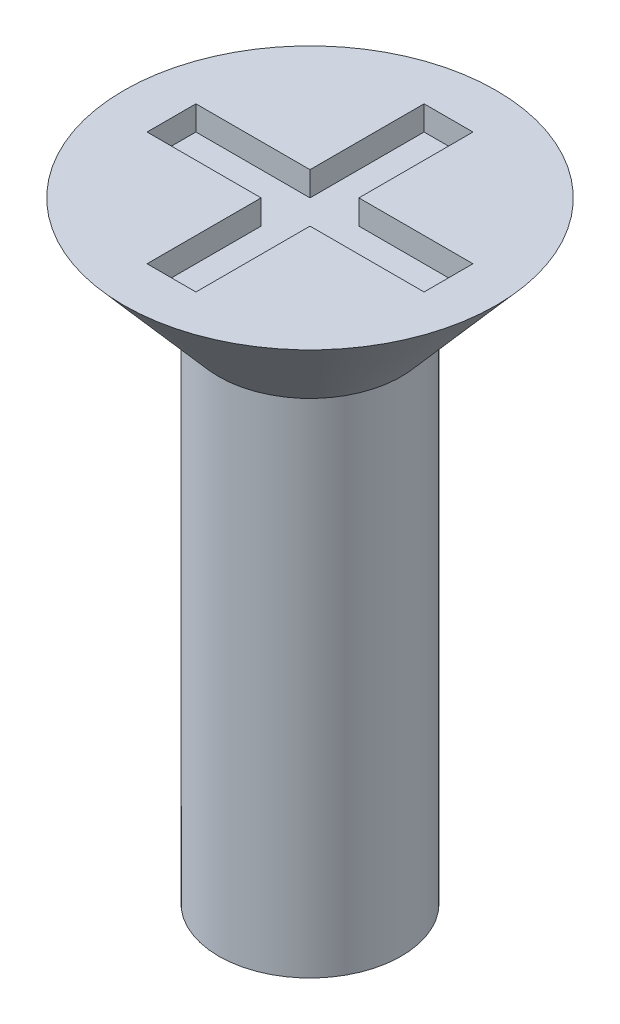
from build123d import *

# Parameters (mm, degrees)
SKETCH2_W              = 0.762
SKETCH2_H              = 2.159
PHILLIPS_DEPTH         = 0.381
PHILLIPS_PATTERN_COUNT = 4


with BuildPart() as part:
    # Sketch1 → FLATHEAD (revolve)
    with BuildSketch(Plane.XY, mode=Mode.PRIVATE) as flathead_sk:
        Polygon((0, 0), (1.4224, 0), (1.4224, 7.8232), (2.90175217, 9.525), (0, 9.525), align=None)
    revolve(flathead_sk.sketch.rotate(Axis((0, 90.869303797, 0), (0, -1, 0)), 90), axis=Axis((0, 90.869303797, 0), (0, -1, 0)))

    # Sketch2 → PHILLIPS (cut)
    with BuildSketch(Plane(origin=(0, 9.525, 0), x_dir=(-1, 0, 0), z_dir=(0, 1, 0))):
        with Locations((0, 1.0795)):
            Rectangle(SKETCH2_W, SKETCH2_H)
    phillips = extrude(amount=-PHILLIPS_DEPTH, mode=Mode.SUBTRACT)

    # PHILLIPS PATTERN: PHILLIPS ×4 about axis
    phillips_pattern_axis = Axis((0, 0, 0), (0, 1, 0))
    for i in range(1, PHILLIPS_PATTERN_COUNT):
        add(phillips.rotate(phillips_pattern_axis, i * 360 / PHILLIPS_PATTERN_COUNT), mode=Mode.SUBTRACT)


solid = part.part
